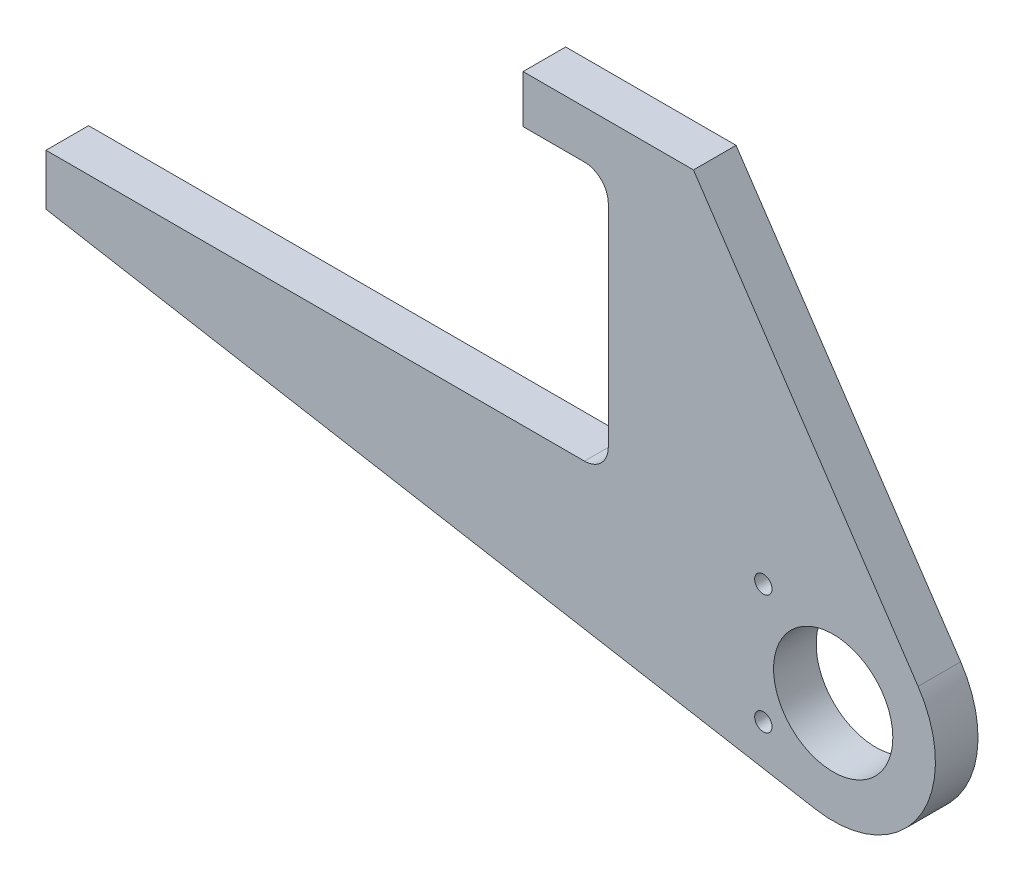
ISO-10303-21;
HEADER;
FILE_DESCRIPTION(('STEP AP214'),'2;1');
FILE_NAME('part.step','',(''),(''),'','','');
FILE_SCHEMA(('AUTOMOTIVE_DESIGN { 1 0 10303 214 1 1 1 1 }'));
ENDSEC;
DATA;
#1=APPLICATION_CONTEXT('core data for automotive mechanical design processes');
#2=APPLICATION_PROTOCOL_DEFINITION('international standard','automotive_design',2000,#1);
#3=PRODUCT_CONTEXT('',#1,'mechanical');
#4=PRODUCT('Part','Part','',(#3));
#5=PRODUCT_RELATED_PRODUCT_CATEGORY('part','',(#4));
#6=PRODUCT_DEFINITION_FORMATION('','',#4);
#7=PRODUCT_DEFINITION_CONTEXT('part definition',#1,'design');
#8=PRODUCT_DEFINITION('design','',#6,#7);
#9=PRODUCT_DEFINITION_SHAPE('','',#8);
#10=(LENGTH_UNIT() NAMED_UNIT(*) SI_UNIT(.MILLI.,.METRE.));
#11=(NAMED_UNIT(*) PLANE_ANGLE_UNIT() SI_UNIT($,.RADIAN.));
#12=(NAMED_UNIT(*) SI_UNIT($,.STERADIAN.) SOLID_ANGLE_UNIT());
#13=UNCERTAINTY_MEASURE_WITH_UNIT(LENGTH_MEASURE(1.E-05),#10,'distance_accuracy_value','');
#14=(GEOMETRIC_REPRESENTATION_CONTEXT(3) GLOBAL_UNCERTAINTY_ASSIGNED_CONTEXT((#13)) GLOBAL_UNIT_ASSIGNED_CONTEXT((#10,
#11,#12)) REPRESENTATION_CONTEXT('',''));
#15=CARTESIAN_POINT('',(0.,0.,0.));
#16=DIRECTION('',(0.,0.,1.));
#17=DIRECTION('',(1.,0.,0.));
#18=AXIS2_PLACEMENT_3D('',#15,#16,#17);
#19=CARTESIAN_POINT('',(0.,0.,25.));
#20=DIRECTION('',(0.,0.,-1.));
#21=DIRECTION('',(-1.,0.,0.));
#22=AXIS2_PLACEMENT_3D('',#19,#20,#21);
#23=PLANE('',#22);
#24=CARTESIAN_POINT('',(-41.,40.,25.));
#25=DIRECTION('',(0.,0.,1.));
#26=DIRECTION('',(1.,0.,0.));
#27=AXIS2_PLACEMENT_3D('',#24,#25,#26);
#28=CIRCLE('',#27,5.09999999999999);
#29=CARTESIAN_POINT('',(-35.9,40.,25.));
#30=VERTEX_POINT('',#29);
#31=EDGE_CURVE('E205',#30,#30,#28,.T.);
#32=ORIENTED_EDGE('',*,*,#31,.F.);
#33=EDGE_LOOP('',(#32));
#34=FACE_BOUND('',#33,.T.);
#35=CARTESIAN_POINT('',(-41.,-30.,25.));
#36=DIRECTION('',(0.,0.,1.));
#37=DIRECTION('',(1.,0.,0.));
#38=AXIS2_PLACEMENT_3D('',#35,#36,#37);
#39=CIRCLE('',#38,5.09999999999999);
#40=CARTESIAN_POINT('',(-35.9,-30.,25.));
#41=VERTEX_POINT('',#40);
#42=EDGE_CURVE('E195',#41,#41,#39,.T.);
#43=ORIENTED_EDGE('',*,*,#42,.F.);
#44=EDGE_LOOP('',(#43));
#45=FACE_BOUND('',#44,.T.);
#46=DIRECTION('',(0.,-1.,0.));
#47=VECTOR('',#46,1.);
#48=CARTESIAN_POINT('',(-462.,50.,25.));
#49=LINE('',#48,#47);
#50=CARTESIAN_POINT('',(-462.,50.,25.));
#51=VERTEX_POINT('',#50);
#52=CARTESIAN_POINT('',(-462.,20.,25.));
#53=VERTEX_POINT('',#52);
#54=EDGE_CURVE('E172',#51,#53,#49,.T.);
#55=ORIENTED_EDGE('',*,*,#54,.T.);
#56=DIRECTION('',(0.985007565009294,-0.172511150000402,0.));
#57=VECTOR('',#56,1.);
#58=CARTESIAN_POINT('',(-10.3506690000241,-59.1004539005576,25.));
#59=LINE('',#58,#57);
#60=CARTESIAN_POINT('',(-10.3506690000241,-59.1004539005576,25.));
#61=VERTEX_POINT('',#60);
#62=EDGE_CURVE('E105',#53,#61,#59,.T.);
#63=ORIENTED_EDGE('',*,*,#62,.T.);
#64=CARTESIAN_POINT('',(0.,0.,25.));
#65=DIRECTION('',(0.,0.,1.));
#66=DIRECTION('',(-1.,0.,0.));
#67=AXIS2_PLACEMENT_3D('',#64,#65,#66);
#68=CIRCLE('',#67,60.);
#69=CARTESIAN_POINT('',(49.8318756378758,33.4183208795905,25.));
#70=VERTEX_POINT('',#69);
#71=EDGE_CURVE('E212',#61,#70,#68,.T.);
#72=ORIENTED_EDGE('',*,*,#71,.T.);
#73=DIRECTION('',(-0.556972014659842,0.830531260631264,0.));
#74=VECTOR('',#73,1.);
#75=CARTESIAN_POINT('',(-82.,230.,25.));
#76=LINE('',#75,#74);
#77=CARTESIAN_POINT('',(-82.,230.,25.));
#78=VERTEX_POINT('',#77);
#79=EDGE_CURVE('E214',#70,#78,#76,.T.);
#80=ORIENTED_EDGE('',*,*,#79,.T.);
#81=DIRECTION('',(-1.,0.,0.));
#82=VECTOR('',#81,1.);
#83=CARTESIAN_POINT('',(-182.,230.,25.));
#84=LINE('',#83,#82);
#85=CARTESIAN_POINT('',(-182.,230.,25.));
#86=VERTEX_POINT('',#85);
#87=EDGE_CURVE('E216',#78,#86,#84,.T.);
#88=ORIENTED_EDGE('',*,*,#87,.T.);
#89=DIRECTION('',(0.,-1.,0.));
#90=VECTOR('',#89,1.);
#91=CARTESIAN_POINT('',(-182.,202.,25.));
#92=LINE('',#91,#90);
#93=CARTESIAN_POINT('',(-182.,202.,25.));
#94=VERTEX_POINT('',#93);
#95=EDGE_CURVE('E218',#86,#94,#92,.T.);
#96=ORIENTED_EDGE('',*,*,#95,.T.);
#97=DIRECTION('',(1.,0.,0.));
#98=VECTOR('',#97,1.);
#99=CARTESIAN_POINT('',(-182.,202.,25.));
#100=LINE('',#99,#98);
#101=CARTESIAN_POINT('',(-146.,202.,25.));
#102=VERTEX_POINT('',#101);
#103=EDGE_CURVE('E220',#94,#102,#100,.T.);
#104=ORIENTED_EDGE('',*,*,#103,.T.);
#105=CARTESIAN_POINT('',(-146.,188.,25.));
#106=DIRECTION('',(0.,0.,-1.));
#107=DIRECTION('',(-1.,0.,0.));
#108=AXIS2_PLACEMENT_3D('',#105,#106,#107);
#109=CIRCLE('',#108,14.);
#110=CARTESIAN_POINT('',(-132.,188.,25.));
#111=VERTEX_POINT('',#110);
#112=EDGE_CURVE('E133',#102,#111,#109,.T.);
#113=ORIENTED_EDGE('',*,*,#112,.T.);
#114=DIRECTION('',(0.,-1.,0.));
#115=VECTOR('',#114,1.);
#116=CARTESIAN_POINT('',(-132.,64.,25.));
#117=LINE('',#116,#115);
#118=CARTESIAN_POINT('',(-132.,64.,25.));
#119=VERTEX_POINT('',#118);
#120=EDGE_CURVE('E127',#111,#119,#117,.T.);
#121=ORIENTED_EDGE('',*,*,#120,.T.);
#122=CARTESIAN_POINT('',(-146.,64.,25.));
#123=DIRECTION('',(0.,0.,-1.));
#124=DIRECTION('',(1.,0.,0.));
#125=AXIS2_PLACEMENT_3D('',#122,#123,#124);
#126=CIRCLE('',#125,14.);
#127=CARTESIAN_POINT('',(-146.,50.,25.));
#128=VERTEX_POINT('',#127);
#129=EDGE_CURVE('E131',#119,#128,#126,.T.);
#130=ORIENTED_EDGE('',*,*,#129,.T.);
#131=DIRECTION('',(-1.,0.,0.));
#132=VECTOR('',#131,1.);
#133=CARTESIAN_POINT('',(-462.,50.,25.));
#134=LINE('',#133,#132);
#135=EDGE_CURVE('E53',#128,#51,#134,.T.);
#136=ORIENTED_EDGE('',*,*,#135,.T.);
#137=EDGE_LOOP('',(#55,#63,#72,#80,#88,#96,#104,#113,#121,#130,#136));
#138=FACE_BOUND('',#137,.T.);
#139=CARTESIAN_POINT('',(0.,0.,25.));
#140=DIRECTION('',(0.,0.,1.));
#141=DIRECTION('',(1.,0.,0.));
#142=AXIS2_PLACEMENT_3D('',#139,#140,#141);
#143=CIRCLE('',#142,35.);
#144=CARTESIAN_POINT('',(35.,0.,25.));
#145=VERTEX_POINT('',#144);
#146=EDGE_CURVE('E155',#145,#145,#143,.T.);
#147=ORIENTED_EDGE('',*,*,#146,.F.);
#148=EDGE_LOOP('',(#147));
#149=FACE_BOUND('',#148,.T.);
#150=ADVANCED_FACE('F34',(#34,#45,#138,#149),#23,.F.);
#151=CARTESIAN_POINT('',(0.,0.,0.));
#152=DIRECTION('',(0.,0.,-1.));
#153=DIRECTION('',(-1.,0.,0.));
#154=AXIS2_PLACEMENT_3D('',#151,#152,#153);
#155=PLANE('',#154);
#156=CARTESIAN_POINT('',(-41.,40.,0.));
#157=DIRECTION('',(0.,0.,-1.));
#158=DIRECTION('',(-1.,0.,0.));
#159=AXIS2_PLACEMENT_3D('',#156,#157,#158);
#160=CIRCLE('',#159,5.09999999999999);
#161=CARTESIAN_POINT('',(-46.1,40.,0.));
#162=VERTEX_POINT('',#161);
#163=EDGE_CURVE('E38',#162,#162,#160,.T.);
#164=ORIENTED_EDGE('',*,*,#163,.F.);
#165=EDGE_LOOP('',(#164));
#166=FACE_BOUND('',#165,.T.);
#167=CARTESIAN_POINT('',(-41.,-30.,0.));
#168=DIRECTION('',(0.,0.,-1.));
#169=DIRECTION('',(-1.,0.,0.));
#170=AXIS2_PLACEMENT_3D('',#167,#168,#169);
#171=CIRCLE('',#170,5.09999999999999);
#172=CARTESIAN_POINT('',(-46.1,-30.,0.));
#173=VERTEX_POINT('',#172);
#174=EDGE_CURVE('E192',#173,#173,#171,.T.);
#175=ORIENTED_EDGE('',*,*,#174,.F.);
#176=EDGE_LOOP('',(#175));
#177=FACE_BOUND('',#176,.T.);
#178=DIRECTION('',(0.,-1.,0.));
#179=VECTOR('',#178,1.);
#180=CARTESIAN_POINT('',(-462.,50.,0.));
#181=LINE('',#180,#179);
#182=CARTESIAN_POINT('',(-462.,50.,0.));
#183=VERTEX_POINT('',#182);
#184=CARTESIAN_POINT('',(-462.,20.,0.));
#185=VERTEX_POINT('',#184);
#186=EDGE_CURVE('E151',#183,#185,#181,.T.);
#187=ORIENTED_EDGE('',*,*,#186,.F.);
#188=DIRECTION('',(-1.,0.,0.));
#189=VECTOR('',#188,1.);
#190=CARTESIAN_POINT('',(-462.,50.,0.));
#191=LINE('',#190,#189);
#192=CARTESIAN_POINT('',(-146.,50.,0.));
#193=VERTEX_POINT('',#192);
#194=EDGE_CURVE('E97',#193,#183,#191,.T.);
#195=ORIENTED_EDGE('',*,*,#194,.F.);
#196=CARTESIAN_POINT('',(-146.,64.,0.));
#197=DIRECTION('',(0.,0.,-1.));
#198=DIRECTION('',(1.,0.,0.));
#199=AXIS2_PLACEMENT_3D('',#196,#197,#198);
#200=CIRCLE('',#199,14.);
#201=CARTESIAN_POINT('',(-132.,64.,0.));
#202=VERTEX_POINT('',#201);
#203=EDGE_CURVE('E91',#202,#193,#200,.T.);
#204=ORIENTED_EDGE('',*,*,#203,.F.);
#205=DIRECTION('',(0.,-1.,0.));
#206=VECTOR('',#205,1.);
#207=CARTESIAN_POINT('',(-132.,64.,0.));
#208=LINE('',#207,#206);
#209=CARTESIAN_POINT('',(-132.,188.,0.));
#210=VERTEX_POINT('',#209);
#211=EDGE_CURVE('E141',#210,#202,#208,.T.);
#212=ORIENTED_EDGE('',*,*,#211,.F.);
#213=CARTESIAN_POINT('',(-146.,188.,0.));
#214=DIRECTION('',(0.,0.,-1.));
#215=DIRECTION('',(-1.,0.,0.));
#216=AXIS2_PLACEMENT_3D('',#213,#214,#215);
#217=CIRCLE('',#216,14.);
#218=CARTESIAN_POINT('',(-146.,202.,0.));
#219=VERTEX_POINT('',#218);
#220=EDGE_CURVE('E167',#219,#210,#217,.T.);
#221=ORIENTED_EDGE('',*,*,#220,.F.);
#222=DIRECTION('',(1.,0.,0.));
#223=VECTOR('',#222,1.);
#224=CARTESIAN_POINT('',(-182.,202.,0.));
#225=LINE('',#224,#223);
#226=CARTESIAN_POINT('',(-182.,202.,0.));
#227=VERTEX_POINT('',#226);
#228=EDGE_CURVE('E165',#227,#219,#225,.T.);
#229=ORIENTED_EDGE('',*,*,#228,.F.);
#230=DIRECTION('',(0.,-1.,0.));
#231=VECTOR('',#230,1.);
#232=CARTESIAN_POINT('',(-182.,202.,0.));
#233=LINE('',#232,#231);
#234=CARTESIAN_POINT('',(-182.,230.,0.));
#235=VERTEX_POINT('',#234);
#236=EDGE_CURVE('E163',#235,#227,#233,.T.);
#237=ORIENTED_EDGE('',*,*,#236,.F.);
#238=DIRECTION('',(-1.,0.,0.));
#239=VECTOR('',#238,1.);
#240=CARTESIAN_POINT('',(-182.,230.,0.));
#241=LINE('',#240,#239);
#242=CARTESIAN_POINT('',(-82.,230.,0.));
#243=VERTEX_POINT('',#242);
#244=EDGE_CURVE('E161',#243,#235,#241,.T.);
#245=ORIENTED_EDGE('',*,*,#244,.F.);
#246=DIRECTION('',(-0.556972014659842,0.830531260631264,0.));
#247=VECTOR('',#246,1.);
#248=CARTESIAN_POINT('',(-82.,230.,0.));
#249=LINE('',#248,#247);
#250=CARTESIAN_POINT('',(49.8318756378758,33.4183208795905,0.));
#251=VERTEX_POINT('',#250);
#252=EDGE_CURVE('E159',#251,#243,#249,.T.);
#253=ORIENTED_EDGE('',*,*,#252,.F.);
#254=CARTESIAN_POINT('',(0.,0.,0.));
#255=DIRECTION('',(0.,0.,1.));
#256=DIRECTION('',(-1.,0.,0.));
#257=AXIS2_PLACEMENT_3D('',#254,#255,#256);
#258=CIRCLE('',#257,60.);
#259=CARTESIAN_POINT('',(-10.3506690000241,-59.1004539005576,0.));
#260=VERTEX_POINT('',#259);
#261=EDGE_CURVE('E157',#260,#251,#258,.T.);
#262=ORIENTED_EDGE('',*,*,#261,.F.);
#263=DIRECTION('',(0.985007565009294,-0.172511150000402,0.));
#264=VECTOR('',#263,1.);
#265=CARTESIAN_POINT('',(-10.3506690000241,-59.1004539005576,0.));
#266=LINE('',#265,#264);
#267=EDGE_CURVE('E154',#185,#260,#266,.T.);
#268=ORIENTED_EDGE('',*,*,#267,.F.);
#269=EDGE_LOOP('',(#187,#195,#204,#212,#221,#229,#237,#245,#253,#262,#268));
#270=FACE_BOUND('',#269,.T.);
#271=CARTESIAN_POINT('',(0.,0.,0.));
#272=DIRECTION('',(0.,0.,1.));
#273=DIRECTION('',(1.,0.,0.));
#274=AXIS2_PLACEMENT_3D('',#271,#272,#273);
#275=CIRCLE('',#274,35.);
#276=CARTESIAN_POINT('',(35.,0.,0.));
#277=VERTEX_POINT('',#276);
#278=EDGE_CURVE('E194',#277,#277,#275,.T.);
#279=ORIENTED_EDGE('',*,*,#278,.T.);
#280=EDGE_LOOP('',(#279));
#281=FACE_BOUND('',#280,.T.);
#282=ADVANCED_FACE('F233',(#166,#177,#270,#281),#155,.T.);
#283=CARTESIAN_POINT('',(-462.,50.,25.));
#284=DIRECTION('',(1.,0.,0.));
#285=DIRECTION('',(0.,0.,-1.));
#286=AXIS2_PLACEMENT_3D('',#283,#284,#285);
#287=PLANE('',#286);
#288=ORIENTED_EDGE('',*,*,#186,.T.);
#289=DIRECTION('',(0.,0.,-1.));
#290=VECTOR('',#289,1.);
#291=CARTESIAN_POINT('',(-462.,20.,25.));
#292=LINE('',#291,#290);
#293=EDGE_CURVE('E11',#53,#185,#292,.T.);
#294=ORIENTED_EDGE('',*,*,#293,.F.);
#295=ORIENTED_EDGE('',*,*,#54,.F.);
#296=DIRECTION('',(0.,0.,-1.));
#297=VECTOR('',#296,1.);
#298=CARTESIAN_POINT('',(-462.,50.,25.));
#299=LINE('',#298,#297);
#300=EDGE_CURVE('E147',#51,#183,#299,.T.);
#301=ORIENTED_EDGE('',*,*,#300,.T.);
#302=EDGE_LOOP('',(#288,#294,#295,#301));
#303=FACE_BOUND('',#302,.T.);
#304=ADVANCED_FACE('F36',(#303),#287,.F.);
#305=CARTESIAN_POINT('',(-10.3506690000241,-59.1004539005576,25.));
#306=DIRECTION('',(0.172511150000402,0.985007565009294,0.));
#307=DIRECTION('',(-0.985007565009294,0.172511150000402,0.));
#308=AXIS2_PLACEMENT_3D('',#305,#306,#307);
#309=PLANE('',#308);
#310=ORIENTED_EDGE('',*,*,#267,.T.);
#311=DIRECTION('',(0.,0.,-1.));
#312=VECTOR('',#311,1.);
#313=CARTESIAN_POINT('',(-10.3506690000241,-59.1004539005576,25.));
#314=LINE('',#313,#312);
#315=EDGE_CURVE('E44',#61,#260,#314,.T.);
#316=ORIENTED_EDGE('',*,*,#315,.F.);
#317=ORIENTED_EDGE('',*,*,#62,.F.);
#318=ORIENTED_EDGE('',*,*,#293,.T.);
#319=EDGE_LOOP('',(#310,#316,#317,#318));
#320=FACE_BOUND('',#319,.T.);
#321=ADVANCED_FACE('F311',(#320),#309,.F.);
#322=CARTESIAN_POINT('',(0.,0.,25.));
#323=DIRECTION('',(0.,0.,-1.));
#324=DIRECTION('',(-1.,0.,0.));
#325=AXIS2_PLACEMENT_3D('',#322,#323,#324);
#326=CYLINDRICAL_SURFACE('',#325,60.);
#327=ORIENTED_EDGE('',*,*,#261,.T.);
#328=DIRECTION('',(0.,0.,-1.));
#329=VECTOR('',#328,1.);
#330=CARTESIAN_POINT('',(49.8318756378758,33.4183208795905,25.));
#331=LINE('',#330,#329);
#332=EDGE_CURVE('E188',#70,#251,#331,.T.);
#333=ORIENTED_EDGE('',*,*,#332,.F.);
#334=ORIENTED_EDGE('',*,*,#71,.F.);
#335=ORIENTED_EDGE('',*,*,#315,.T.);
#336=EDGE_LOOP('',(#327,#333,#334,#335));
#337=FACE_BOUND('',#336,.T.);
#338=ADVANCED_FACE('F316',(#337),#326,.T.);
#339=CARTESIAN_POINT('',(-82.,230.,25.));
#340=DIRECTION('',(-0.830531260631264,-0.556972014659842,0.));
#341=DIRECTION('',(0.556972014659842,-0.830531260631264,0.));
#342=AXIS2_PLACEMENT_3D('',#339,#340,#341);
#343=PLANE('',#342);
#344=ORIENTED_EDGE('',*,*,#252,.T.);
#345=DIRECTION('',(0.,0.,-1.));
#346=VECTOR('',#345,1.);
#347=CARTESIAN_POINT('',(-82.,230.,25.));
#348=LINE('',#347,#346);
#349=EDGE_CURVE('E185',#78,#243,#348,.T.);
#350=ORIENTED_EDGE('',*,*,#349,.F.);
#351=ORIENTED_EDGE('',*,*,#79,.F.);
#352=ORIENTED_EDGE('',*,*,#332,.T.);
#353=EDGE_LOOP('',(#344,#350,#351,#352));
#354=FACE_BOUND('',#353,.T.);
#355=ADVANCED_FACE('F322',(#354),#343,.F.);
#356=CARTESIAN_POINT('',(-182.,230.,25.));
#357=DIRECTION('',(0.,-1.,0.));
#358=DIRECTION('',(0.,0.,-1.));
#359=AXIS2_PLACEMENT_3D('',#356,#357,#358);
#360=PLANE('',#359);
#361=ORIENTED_EDGE('',*,*,#244,.T.);
#362=DIRECTION('',(0.,0.,-1.));
#363=VECTOR('',#362,1.);
#364=CARTESIAN_POINT('',(-182.,230.,25.));
#365=LINE('',#364,#363);
#366=EDGE_CURVE('E182',#86,#235,#365,.T.);
#367=ORIENTED_EDGE('',*,*,#366,.F.);
#368=ORIENTED_EDGE('',*,*,#87,.F.);
#369=ORIENTED_EDGE('',*,*,#349,.T.);
#370=EDGE_LOOP('',(#361,#367,#368,#369));
#371=FACE_BOUND('',#370,.T.);
#372=ADVANCED_FACE('F330',(#371),#360,.F.);
#373=CARTESIAN_POINT('',(-182.,202.,25.));
#374=DIRECTION('',(1.,0.,0.));
#375=DIRECTION('',(0.,0.,-1.));
#376=AXIS2_PLACEMENT_3D('',#373,#374,#375);
#377=PLANE('',#376);
#378=ORIENTED_EDGE('',*,*,#236,.T.);
#379=DIRECTION('',(0.,0.,-1.));
#380=VECTOR('',#379,1.);
#381=CARTESIAN_POINT('',(-182.,202.,25.));
#382=LINE('',#381,#380);
#383=EDGE_CURVE('E179',#94,#227,#382,.T.);
#384=ORIENTED_EDGE('',*,*,#383,.F.);
#385=ORIENTED_EDGE('',*,*,#95,.F.);
#386=ORIENTED_EDGE('',*,*,#366,.T.);
#387=EDGE_LOOP('',(#378,#384,#385,#386));
#388=FACE_BOUND('',#387,.T.);
#389=ADVANCED_FACE('F338',(#388),#377,.F.);
#390=CARTESIAN_POINT('',(-182.,202.,25.));
#391=DIRECTION('',(0.,1.,0.));
#392=DIRECTION('',(0.,0.,1.));
#393=AXIS2_PLACEMENT_3D('',#390,#391,#392);
#394=PLANE('',#393);
#395=ORIENTED_EDGE('',*,*,#228,.T.);
#396=DIRECTION('',(0.,0.,-1.));
#397=VECTOR('',#396,1.);
#398=CARTESIAN_POINT('',(-146.,202.,25.));
#399=LINE('',#398,#397);
#400=EDGE_CURVE('E176',#102,#219,#399,.T.);
#401=ORIENTED_EDGE('',*,*,#400,.F.);
#402=ORIENTED_EDGE('',*,*,#103,.F.);
#403=ORIENTED_EDGE('',*,*,#383,.T.);
#404=EDGE_LOOP('',(#395,#401,#402,#403));
#405=FACE_BOUND('',#404,.T.);
#406=ADVANCED_FACE('F226',(#405),#394,.F.);
#407=CARTESIAN_POINT('',(-146.,188.,25.));
#408=DIRECTION('',(0.,0.,-1.));
#409=DIRECTION('',(-1.,0.,0.));
#410=AXIS2_PLACEMENT_3D('',#407,#408,#409);
#411=CYLINDRICAL_SURFACE('',#410,14.);
#412=ORIENTED_EDGE('',*,*,#220,.T.);
#413=DIRECTION('',(0.,0.,-1.));
#414=VECTOR('',#413,1.);
#415=CARTESIAN_POINT('',(-132.,188.,25.));
#416=LINE('',#415,#414);
#417=EDGE_CURVE('E142',#111,#210,#416,.T.);
#418=ORIENTED_EDGE('',*,*,#417,.F.);
#419=ORIENTED_EDGE('',*,*,#112,.F.);
#420=ORIENTED_EDGE('',*,*,#400,.T.);
#421=EDGE_LOOP('',(#412,#418,#419,#420));
#422=FACE_BOUND('',#421,.T.);
#423=ADVANCED_FACE('F230',(#422),#411,.F.);
#424=CARTESIAN_POINT('',(-132.,64.,25.));
#425=DIRECTION('',(1.,0.,0.));
#426=DIRECTION('',(0.,0.,-1.));
#427=AXIS2_PLACEMENT_3D('',#424,#425,#426);
#428=PLANE('',#427);
#429=ORIENTED_EDGE('',*,*,#211,.T.);
#430=DIRECTION('',(0.,0.,-1.));
#431=VECTOR('',#430,1.);
#432=CARTESIAN_POINT('',(-132.,64.,25.));
#433=LINE('',#432,#431);
#434=EDGE_CURVE('E138',#119,#202,#433,.T.);
#435=ORIENTED_EDGE('',*,*,#434,.F.);
#436=ORIENTED_EDGE('',*,*,#120,.F.);
#437=ORIENTED_EDGE('',*,*,#417,.T.);
#438=EDGE_LOOP('',(#429,#435,#436,#437));
#439=FACE_BOUND('',#438,.T.);
#440=ADVANCED_FACE('F139',(#439),#428,.F.);
#441=CARTESIAN_POINT('',(-146.,64.,25.));
#442=DIRECTION('',(0.,0.,-1.));
#443=DIRECTION('',(-1.,0.,0.));
#444=AXIS2_PLACEMENT_3D('',#441,#442,#443);
#445=CYLINDRICAL_SURFACE('',#444,14.);
#446=ORIENTED_EDGE('',*,*,#203,.T.);
#447=DIRECTION('',(0.,0.,-1.));
#448=VECTOR('',#447,1.);
#449=CARTESIAN_POINT('',(-146.,50.,25.));
#450=LINE('',#449,#448);
#451=EDGE_CURVE('E143',#128,#193,#450,.T.);
#452=ORIENTED_EDGE('',*,*,#451,.F.);
#453=ORIENTED_EDGE('',*,*,#129,.F.);
#454=ORIENTED_EDGE('',*,*,#434,.T.);
#455=EDGE_LOOP('',(#446,#452,#453,#454));
#456=FACE_BOUND('',#455,.T.);
#457=ADVANCED_FACE('F145',(#456),#445,.F.);
#458=CARTESIAN_POINT('',(-462.,50.,25.));
#459=DIRECTION('',(0.,-1.,0.));
#460=DIRECTION('',(0.,0.,-1.));
#461=AXIS2_PLACEMENT_3D('',#458,#459,#460);
#462=PLANE('',#461);
#463=ORIENTED_EDGE('',*,*,#194,.T.);
#464=ORIENTED_EDGE('',*,*,#300,.F.);
#465=ORIENTED_EDGE('',*,*,#135,.F.);
#466=ORIENTED_EDGE('',*,*,#451,.T.);
#467=EDGE_LOOP('',(#463,#464,#465,#466));
#468=FACE_BOUND('',#467,.T.);
#469=ADVANCED_FACE('F239',(#468),#462,.F.);
#470=CARTESIAN_POINT('',(0.,0.,25.));
#471=DIRECTION('',(0.,0.,-1.));
#472=DIRECTION('',(-1.,0.,0.));
#473=AXIS2_PLACEMENT_3D('',#470,#471,#472);
#474=CYLINDRICAL_SURFACE('',#473,35.);
#475=ORIENTED_EDGE('',*,*,#146,.T.);
#476=EDGE_LOOP('',(#475));
#477=FACE_BOUND('',#476,.T.);
#478=ORIENTED_EDGE('',*,*,#278,.F.);
#479=EDGE_LOOP('',(#478));
#480=FACE_BOUND('',#479,.T.);
#481=ADVANCED_FACE('F241',(#477,#480),#474,.F.);
#482=CARTESIAN_POINT('',(-41.,-30.,25.));
#483=DIRECTION('',(0.,0.,1.));
#484=DIRECTION('',(1.,0.,0.));
#485=AXIS2_PLACEMENT_3D('',#482,#483,#484);
#486=CYLINDRICAL_SURFACE('',#485,5.09999999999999);
#487=ORIENTED_EDGE('',*,*,#174,.T.);
#488=EDGE_LOOP('',(#487));
#489=FACE_BOUND('',#488,.T.);
#490=ORIENTED_EDGE('',*,*,#42,.T.);
#491=EDGE_LOOP('',(#490));
#492=FACE_BOUND('',#491,.T.);
#493=ADVANCED_FACE('F247',(#489,#492),#486,.F.);
#494=CARTESIAN_POINT('',(-41.,40.,25.));
#495=DIRECTION('',(0.,0.,1.));
#496=DIRECTION('',(1.,0.,0.));
#497=AXIS2_PLACEMENT_3D('',#494,#495,#496);
#498=CYLINDRICAL_SURFACE('',#497,5.09999999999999);
#499=ORIENTED_EDGE('',*,*,#163,.T.);
#500=EDGE_LOOP('',(#499));
#501=FACE_BOUND('',#500,.T.);
#502=ORIENTED_EDGE('',*,*,#31,.T.);
#503=EDGE_LOOP('',(#502));
#504=FACE_BOUND('',#503,.T.);
#505=ADVANCED_FACE('F264',(#501,#504),#498,.F.);
#506=CLOSED_SHELL('',(#150,#282,#304,#321,#338,#355,#372,#389,#406,#423,#440,#457,#469,#481,
#493,#505));
#507=MANIFOLD_SOLID_BREP('B2',#506);
#508=ADVANCED_BREP_SHAPE_REPRESENTATION('',(#18,#507),#14);
#509=SHAPE_DEFINITION_REPRESENTATION(#9,#508);
ENDSEC;
END-ISO-10303-21;
